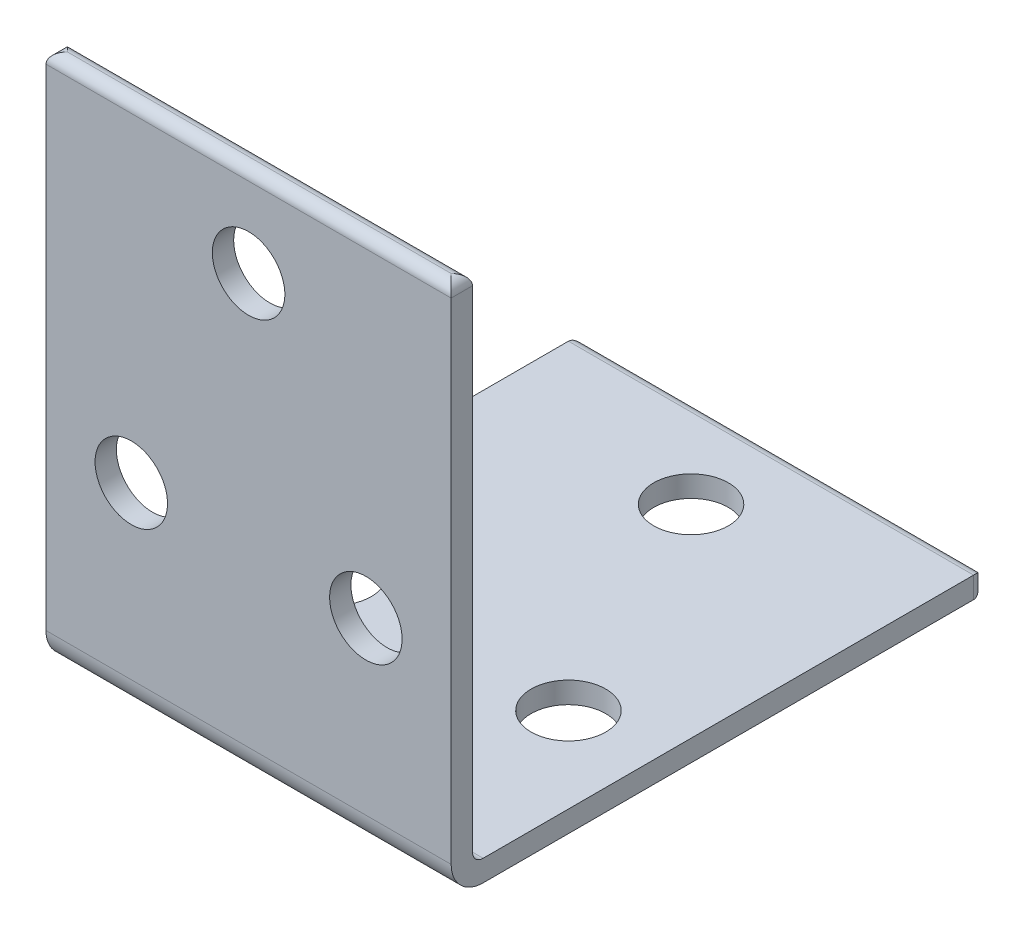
ISO-10303-21;
HEADER;
FILE_DESCRIPTION(('STEP AP214'),'2;1');
FILE_NAME('part.step','',(''),(''),'','','');
FILE_SCHEMA(('AUTOMOTIVE_DESIGN { 1 0 10303 214 1 1 1 1 }'));
ENDSEC;
DATA;
#1=APPLICATION_CONTEXT('core data for automotive mechanical design processes');
#2=APPLICATION_PROTOCOL_DEFINITION('international standard','automotive_design',2000,#1);
#3=PRODUCT_CONTEXT('',#1,'mechanical');
#4=PRODUCT('Part','Part','',(#3));
#5=PRODUCT_RELATED_PRODUCT_CATEGORY('part','',(#4));
#6=PRODUCT_DEFINITION_FORMATION('','',#4);
#7=PRODUCT_DEFINITION_CONTEXT('part definition',#1,'design');
#8=PRODUCT_DEFINITION('design','',#6,#7);
#9=PRODUCT_DEFINITION_SHAPE('','',#8);
#10=(LENGTH_UNIT() NAMED_UNIT(*) SI_UNIT(.MILLI.,.METRE.));
#11=(NAMED_UNIT(*) PLANE_ANGLE_UNIT() SI_UNIT($,.RADIAN.));
#12=(NAMED_UNIT(*) SI_UNIT($,.STERADIAN.) SOLID_ANGLE_UNIT());
#13=UNCERTAINTY_MEASURE_WITH_UNIT(LENGTH_MEASURE(1.E-05),#10,'distance_accuracy_value','');
#14=(GEOMETRIC_REPRESENTATION_CONTEXT(3) GLOBAL_UNCERTAINTY_ASSIGNED_CONTEXT((#13)) GLOBAL_UNIT_ASSIGNED_CONTEXT((#10,
#11,#12)) REPRESENTATION_CONTEXT('',''));
#15=CARTESIAN_POINT('',(0.,0.,0.));
#16=DIRECTION('',(0.,0.,1.));
#17=DIRECTION('',(1.,0.,0.));
#18=AXIS2_PLACEMENT_3D('',#15,#16,#17);
#19=CARTESIAN_POINT('',(38.,50.,48.));
#20=DIRECTION('',(0.,0.,1.));
#21=DIRECTION('',(1.,0.,0.));
#22=AXIS2_PLACEMENT_3D('',#19,#20,#21);
#23=PLANE('',#22);
#24=CARTESIAN_POINT('',(19.,41.5,48.));
#25=DIRECTION('',(0.,0.,-1.));
#26=DIRECTION('',(-1.,0.,0.));
#27=AXIS2_PLACEMENT_3D('',#24,#25,#26);
#28=CIRCLE('',#27,3.4);
#29=CARTESIAN_POINT('',(15.6,41.5,48.));
#30=VERTEX_POINT('',#29);
#31=EDGE_CURVE('E143',#30,#30,#28,.T.);
#32=ORIENTED_EDGE('',*,*,#31,.F.);
#33=EDGE_LOOP('',(#32));
#34=FACE_BOUND('',#33,.T.);
#35=CARTESIAN_POINT('',(30.,19.,48.));
#36=DIRECTION('',(0.,0.,-1.));
#37=DIRECTION('',(-1.,0.,0.));
#38=AXIS2_PLACEMENT_3D('',#35,#36,#37);
#39=CIRCLE('',#38,3.4);
#40=CARTESIAN_POINT('',(26.6,19.,48.));
#41=VERTEX_POINT('',#40);
#42=EDGE_CURVE('E128',#41,#41,#39,.T.);
#43=ORIENTED_EDGE('',*,*,#42,.F.);
#44=EDGE_LOOP('',(#43));
#45=FACE_BOUND('',#44,.T.);
#46=CARTESIAN_POINT('',(8.,19.,48.));
#47=DIRECTION('',(0.,0.,-1.));
#48=DIRECTION('',(-1.,0.,0.));
#49=AXIS2_PLACEMENT_3D('',#46,#47,#48);
#50=CIRCLE('',#49,3.4);
#51=CARTESIAN_POINT('',(4.6,19.,48.));
#52=VERTEX_POINT('',#51);
#53=EDGE_CURVE('E117',#52,#52,#50,.T.);
#54=ORIENTED_EDGE('',*,*,#53,.F.);
#55=EDGE_LOOP('',(#54));
#56=FACE_BOUND('',#55,.T.);
#57=DIRECTION('',(0.,1.,0.));
#58=VECTOR('',#57,1.);
#59=CARTESIAN_POINT('',(0.,50.,48.));
#60=LINE('',#59,#58);
#61=CARTESIAN_POINT('',(0.,3.00000000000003,48.));
#62=VERTEX_POINT('',#61);
#63=CARTESIAN_POINT('',(0.,49.,48.));
#64=VERTEX_POINT('',#63);
#65=EDGE_CURVE('E173',#62,#64,#60,.T.);
#66=ORIENTED_EDGE('',*,*,#65,.T.);
#67=DIRECTION('',(-1.,0.,0.));
#68=VECTOR('',#67,1.);
#69=CARTESIAN_POINT('',(38.,49.,48.));
#70=LINE('',#69,#68);
#71=CARTESIAN_POINT('',(38.,49.,48.));
#72=VERTEX_POINT('',#71);
#73=EDGE_CURVE('E11',#64,#72,#70,.F.);
#74=ORIENTED_EDGE('',*,*,#73,.T.);
#75=DIRECTION('',(0.,1.,0.));
#76=VECTOR('',#75,1.);
#77=CARTESIAN_POINT('',(38.,50.,48.));
#78=LINE('',#77,#76);
#79=CARTESIAN_POINT('',(38.,3.00000000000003,48.));
#80=VERTEX_POINT('',#79);
#81=EDGE_CURVE('E147',#80,#72,#78,.T.);
#82=ORIENTED_EDGE('',*,*,#81,.F.);
#83=DIRECTION('',(-1.,0.,0.));
#84=VECTOR('',#83,1.);
#85=CARTESIAN_POINT('',(38.,3.00000000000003,48.));
#86=LINE('',#85,#84);
#87=EDGE_CURVE('E172',#80,#62,#86,.T.);
#88=ORIENTED_EDGE('',*,*,#87,.T.);
#89=EDGE_LOOP('',(#66,#74,#82,#88));
#90=FACE_BOUND('',#89,.T.);
#91=ADVANCED_FACE('F51',(#34,#45,#56,#90),#23,.F.);
#92=CARTESIAN_POINT('',(38.,50.,50.));
#93=DIRECTION('',(0.,0.,-1.));
#94=DIRECTION('',(-1.,0.,0.));
#95=AXIS2_PLACEMENT_3D('',#92,#93,#94);
#96=PLANE('',#95);
#97=CARTESIAN_POINT('',(19.,41.5,50.));
#98=DIRECTION('',(0.,0.,-1.));
#99=DIRECTION('',(-1.,0.,0.));
#100=AXIS2_PLACEMENT_3D('',#97,#98,#99);
#101=CIRCLE('',#100,3.4);
#102=CARTESIAN_POINT('',(15.6,41.5,50.));
#103=VERTEX_POINT('',#102);
#104=EDGE_CURVE('E55',#103,#103,#101,.T.);
#105=ORIENTED_EDGE('',*,*,#104,.T.);
#106=EDGE_LOOP('',(#105));
#107=FACE_BOUND('',#106,.T.);
#108=CARTESIAN_POINT('',(30.,19.,50.));
#109=DIRECTION('',(0.,0.,-1.));
#110=DIRECTION('',(-1.,0.,0.));
#111=AXIS2_PLACEMENT_3D('',#108,#109,#110);
#112=CIRCLE('',#111,3.4);
#113=CARTESIAN_POINT('',(26.6,19.,50.));
#114=VERTEX_POINT('',#113);
#115=EDGE_CURVE('E125',#114,#114,#112,.T.);
#116=ORIENTED_EDGE('',*,*,#115,.T.);
#117=EDGE_LOOP('',(#116));
#118=FACE_BOUND('',#117,.T.);
#119=CARTESIAN_POINT('',(8.,19.,50.));
#120=DIRECTION('',(0.,0.,-1.));
#121=DIRECTION('',(-1.,0.,0.));
#122=AXIS2_PLACEMENT_3D('',#119,#120,#121);
#123=CIRCLE('',#122,3.4);
#124=CARTESIAN_POINT('',(4.6,19.,50.));
#125=VERTEX_POINT('',#124);
#126=EDGE_CURVE('E110',#125,#125,#123,.T.);
#127=ORIENTED_EDGE('',*,*,#126,.T.);
#128=EDGE_LOOP('',(#127));
#129=FACE_BOUND('',#128,.T.);
#130=DIRECTION('',(0.,-1.,0.));
#131=VECTOR('',#130,1.);
#132=CARTESIAN_POINT('',(38.,50.,50.));
#133=LINE('',#132,#131);
#134=CARTESIAN_POINT('',(38.,49.,50.));
#135=VERTEX_POINT('',#134);
#136=CARTESIAN_POINT('',(38.,3.00000000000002,50.));
#137=VERTEX_POINT('',#136);
#138=EDGE_CURVE('E151',#135,#137,#133,.T.);
#139=ORIENTED_EDGE('',*,*,#138,.F.);
#140=DIRECTION('',(-1.,0.,0.));
#141=VECTOR('',#140,1.);
#142=CARTESIAN_POINT('',(38.,49.,50.));
#143=LINE('',#142,#141);
#144=CARTESIAN_POINT('',(0.,49.,50.));
#145=VERTEX_POINT('',#144);
#146=EDGE_CURVE('E62',#135,#145,#143,.T.);
#147=ORIENTED_EDGE('',*,*,#146,.T.);
#148=DIRECTION('',(0.,-1.,0.));
#149=VECTOR('',#148,1.);
#150=CARTESIAN_POINT('',(0.,50.,50.));
#151=LINE('',#150,#149);
#152=CARTESIAN_POINT('',(0.,3.00000000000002,50.));
#153=VERTEX_POINT('',#152);
#154=EDGE_CURVE('E177',#145,#153,#151,.T.);
#155=ORIENTED_EDGE('',*,*,#154,.T.);
#156=DIRECTION('',(-1.,0.,0.));
#157=VECTOR('',#156,1.);
#158=CARTESIAN_POINT('',(38.,3.00000000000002,50.));
#159=LINE('',#158,#157);
#160=EDGE_CURVE('E207',#137,#153,#159,.T.);
#161=ORIENTED_EDGE('',*,*,#160,.F.);
#162=EDGE_LOOP('',(#139,#147,#155,#161));
#163=FACE_BOUND('',#162,.T.);
#164=ADVANCED_FACE('F308',(#107,#118,#129,#163),#96,.F.);
#165=CARTESIAN_POINT('',(38.,3.,47.));
#166=DIRECTION('',(-1.,0.,0.));
#167=DIRECTION('',(0.,0.,1.));
#168=AXIS2_PLACEMENT_3D('',#165,#166,#167);
#169=CYLINDRICAL_SURFACE('',#168,3.);
#170=CARTESIAN_POINT('',(0.,3.,47.));
#171=DIRECTION('',(1.,0.,0.));
#172=DIRECTION('',(0.,0.,-1.));
#173=AXIS2_PLACEMENT_3D('',#170,#171,#172);
#174=CIRCLE('',#173,3.);
#175=CARTESIAN_POINT('',(0.,0.,47.));
#176=VERTEX_POINT('',#175);
#177=EDGE_CURVE('E181',#153,#176,#174,.T.);
#178=ORIENTED_EDGE('',*,*,#177,.T.);
#179=DIRECTION('',(-1.,0.,0.));
#180=VECTOR('',#179,1.);
#181=CARTESIAN_POINT('',(38.,0.,47.));
#182=LINE('',#181,#180);
#183=CARTESIAN_POINT('',(38.,0.,47.));
#184=VERTEX_POINT('',#183);
#185=EDGE_CURVE('E203',#184,#176,#182,.T.);
#186=ORIENTED_EDGE('',*,*,#185,.F.);
#187=CARTESIAN_POINT('',(38.,3.,47.));
#188=DIRECTION('',(1.,0.,0.));
#189=DIRECTION('',(0.,0.,-1.));
#190=AXIS2_PLACEMENT_3D('',#187,#188,#189);
#191=CIRCLE('',#190,3.);
#192=EDGE_CURVE('E156',#137,#184,#191,.T.);
#193=ORIENTED_EDGE('',*,*,#192,.F.);
#194=ORIENTED_EDGE('',*,*,#160,.T.);
#195=EDGE_LOOP('',(#178,#186,#193,#194));
#196=FACE_BOUND('',#195,.T.);
#197=ADVANCED_FACE('F314',(#196),#169,.T.);
#198=CARTESIAN_POINT('',(38.,0.,47.));
#199=DIRECTION('',(0.,1.,0.));
#200=DIRECTION('',(0.,0.,1.));
#201=AXIS2_PLACEMENT_3D('',#198,#199,#200);
#202=PLANE('',#201);
#203=CARTESIAN_POINT('',(19.,0.,8.5));
#204=DIRECTION('',(0.,1.,0.));
#205=DIRECTION('',(0.,0.,1.));
#206=AXIS2_PLACEMENT_3D('',#203,#204,#205);
#207=CIRCLE('',#206,3.5);
#208=CARTESIAN_POINT('',(19.,0.,12.));
#209=VERTEX_POINT('',#208);
#210=EDGE_CURVE('E568',#209,#209,#207,.T.);
#211=ORIENTED_EDGE('',*,*,#210,.T.);
#212=EDGE_LOOP('',(#211));
#213=FACE_BOUND('',#212,.T.);
#214=CARTESIAN_POINT('',(8.,0.,31.));
#215=DIRECTION('',(0.,1.,0.));
#216=DIRECTION('',(0.,0.,1.));
#217=AXIS2_PLACEMENT_3D('',#214,#215,#216);
#218=CIRCLE('',#217,3.5);
#219=CARTESIAN_POINT('',(8.,0.,34.5));
#220=VERTEX_POINT('',#219);
#221=EDGE_CURVE('E576',#220,#220,#218,.T.);
#222=ORIENTED_EDGE('',*,*,#221,.T.);
#223=EDGE_LOOP('',(#222));
#224=FACE_BOUND('',#223,.T.);
#225=CARTESIAN_POINT('',(30.,0.,31.));
#226=DIRECTION('',(0.,1.,0.));
#227=DIRECTION('',(0.,0.,1.));
#228=AXIS2_PLACEMENT_3D('',#225,#226,#227);
#229=CIRCLE('',#228,3.5);
#230=CARTESIAN_POINT('',(30.,0.,34.5));
#231=VERTEX_POINT('',#230);
#232=EDGE_CURVE('E586',#231,#231,#229,.T.);
#233=ORIENTED_EDGE('',*,*,#232,.T.);
#234=EDGE_LOOP('',(#233));
#235=FACE_BOUND('',#234,.T.);
#236=DIRECTION('',(0.,0.,-1.));
#237=VECTOR('',#236,1.);
#238=CARTESIAN_POINT('',(0.,0.,47.));
#239=LINE('',#238,#237);
#240=CARTESIAN_POINT('',(0.,0.,1.));
#241=VERTEX_POINT('',#240);
#242=EDGE_CURVE('E185',#176,#241,#239,.T.);
#243=ORIENTED_EDGE('',*,*,#242,.T.);
#244=DIRECTION('',(-1.,0.,0.));
#245=VECTOR('',#244,1.);
#246=CARTESIAN_POINT('',(38.,0.,1.));
#247=LINE('',#246,#245);
#248=CARTESIAN_POINT('',(38.,0.,1.));
#249=VERTEX_POINT('',#248);
#250=EDGE_CURVE('E211',#241,#249,#247,.F.);
#251=ORIENTED_EDGE('',*,*,#250,.T.);
#252=DIRECTION('',(0.,0.,-1.));
#253=VECTOR('',#252,1.);
#254=CARTESIAN_POINT('',(38.,0.,47.));
#255=LINE('',#254,#253);
#256=EDGE_CURVE('E160',#184,#249,#255,.T.);
#257=ORIENTED_EDGE('',*,*,#256,.F.);
#258=ORIENTED_EDGE('',*,*,#185,.T.);
#259=EDGE_LOOP('',(#243,#251,#257,#258));
#260=FACE_BOUND('',#259,.T.);
#261=ADVANCED_FACE('F320',(#213,#224,#235,#260),#202,.F.);
#262=CARTESIAN_POINT('',(38.,2.,47.));
#263=DIRECTION('',(0.,-1.,0.));
#264=DIRECTION('',(0.,0.,-1.));
#265=AXIS2_PLACEMENT_3D('',#262,#263,#264);
#266=PLANE('',#265);
#267=CARTESIAN_POINT('',(19.,2.,8.5));
#268=DIRECTION('',(0.,1.,0.));
#269=DIRECTION('',(0.,0.,1.));
#270=AXIS2_PLACEMENT_3D('',#267,#268,#269);
#271=CIRCLE('',#270,3.5);
#272=CARTESIAN_POINT('',(19.,2.,12.));
#273=VERTEX_POINT('',#272);
#274=EDGE_CURVE('E566',#273,#273,#271,.T.);
#275=ORIENTED_EDGE('',*,*,#274,.F.);
#276=EDGE_LOOP('',(#275));
#277=FACE_BOUND('',#276,.T.);
#278=CARTESIAN_POINT('',(8.,2.,31.));
#279=DIRECTION('',(0.,1.,0.));
#280=DIRECTION('',(0.,0.,1.));
#281=AXIS2_PLACEMENT_3D('',#278,#279,#280);
#282=CIRCLE('',#281,3.5);
#283=CARTESIAN_POINT('',(8.,2.,34.5));
#284=VERTEX_POINT('',#283);
#285=EDGE_CURVE('E570',#284,#284,#282,.T.);
#286=ORIENTED_EDGE('',*,*,#285,.F.);
#287=EDGE_LOOP('',(#286));
#288=FACE_BOUND('',#287,.T.);
#289=CARTESIAN_POINT('',(30.,2.,31.));
#290=DIRECTION('',(0.,1.,0.));
#291=DIRECTION('',(0.,0.,1.));
#292=AXIS2_PLACEMENT_3D('',#289,#290,#291);
#293=CIRCLE('',#292,3.5);
#294=CARTESIAN_POINT('',(30.,2.,34.5));
#295=VERTEX_POINT('',#294);
#296=EDGE_CURVE('E583',#295,#295,#293,.T.);
#297=ORIENTED_EDGE('',*,*,#296,.F.);
#298=EDGE_LOOP('',(#297));
#299=FACE_BOUND('',#298,.T.);
#300=DIRECTION('',(0.,0.,1.));
#301=VECTOR('',#300,1.);
#302=CARTESIAN_POINT('',(38.,2.,47.));
#303=LINE('',#302,#301);
#304=CARTESIAN_POINT('',(38.,2.,1.));
#305=VERTEX_POINT('',#304);
#306=CARTESIAN_POINT('',(38.,2.,47.));
#307=VERTEX_POINT('',#306);
#308=EDGE_CURVE('E164',#305,#307,#303,.T.);
#309=ORIENTED_EDGE('',*,*,#308,.F.);
#310=DIRECTION('',(-1.,0.,0.));
#311=VECTOR('',#310,1.);
#312=CARTESIAN_POINT('',(38.,2.,1.));
#313=LINE('',#312,#311);
#314=CARTESIAN_POINT('',(0.,2.,1.));
#315=VERTEX_POINT('',#314);
#316=EDGE_CURVE('E223',#305,#315,#313,.T.);
#317=ORIENTED_EDGE('',*,*,#316,.T.);
#318=DIRECTION('',(0.,0.,1.));
#319=VECTOR('',#318,1.);
#320=CARTESIAN_POINT('',(0.,2.,47.));
#321=LINE('',#320,#319);
#322=CARTESIAN_POINT('',(0.,2.,47.));
#323=VERTEX_POINT('',#322);
#324=EDGE_CURVE('E189',#315,#323,#321,.T.);
#325=ORIENTED_EDGE('',*,*,#324,.T.);
#326=DIRECTION('',(-1.,0.,0.));
#327=VECTOR('',#326,1.);
#328=CARTESIAN_POINT('',(38.,2.,47.));
#329=LINE('',#328,#327);
#330=EDGE_CURVE('E199',#307,#323,#329,.T.);
#331=ORIENTED_EDGE('',*,*,#330,.F.);
#332=EDGE_LOOP('',(#309,#317,#325,#331));
#333=FACE_BOUND('',#332,.T.);
#334=ADVANCED_FACE('F288',(#277,#288,#299,#333),#266,.F.);
#335=CARTESIAN_POINT('',(38.,3.,47.));
#336=DIRECTION('',(-1.,0.,0.));
#337=DIRECTION('',(0.,0.,1.));
#338=AXIS2_PLACEMENT_3D('',#335,#336,#337);
#339=CYLINDRICAL_SURFACE('',#338,1.);
#340=CARTESIAN_POINT('',(0.,3.,47.));
#341=DIRECTION('',(-1.,0.,0.));
#342=DIRECTION('',(0.,0.,-1.));
#343=AXIS2_PLACEMENT_3D('',#340,#341,#342);
#344=CIRCLE('',#343,1.);
#345=EDGE_CURVE('E152',#323,#62,#344,.T.);
#346=ORIENTED_EDGE('',*,*,#345,.T.);
#347=ORIENTED_EDGE('',*,*,#87,.F.);
#348=CARTESIAN_POINT('',(38.,3.,47.));
#349=DIRECTION('',(-1.,0.,0.));
#350=DIRECTION('',(0.,0.,-1.));
#351=AXIS2_PLACEMENT_3D('',#348,#349,#350);
#352=CIRCLE('',#351,1.);
#353=EDGE_CURVE('E168',#307,#80,#352,.T.);
#354=ORIENTED_EDGE('',*,*,#353,.F.);
#355=ORIENTED_EDGE('',*,*,#330,.T.);
#356=EDGE_LOOP('',(#346,#347,#354,#355));
#357=FACE_BOUND('',#356,.T.);
#358=ADVANCED_FACE('F297',(#357),#339,.F.);
#359=CARTESIAN_POINT('',(38.,3.,47.));
#360=DIRECTION('',(1.,0.,0.));
#361=DIRECTION('',(0.,0.,-1.));
#362=AXIS2_PLACEMENT_3D('',#359,#360,#361);
#363=PLANE('',#362);
#364=ORIENTED_EDGE('',*,*,#256,.T.);
#365=DIRECTION('',(0.,1.,0.));
#366=VECTOR('',#365,1.);
#367=CARTESIAN_POINT('',(38.,2.,1.));
#368=LINE('',#367,#366);
#369=EDGE_CURVE('E219',#249,#305,#368,.T.);
#370=ORIENTED_EDGE('',*,*,#369,.T.);
#371=ORIENTED_EDGE('',*,*,#308,.T.);
#372=ORIENTED_EDGE('',*,*,#353,.T.);
#373=ORIENTED_EDGE('',*,*,#81,.T.);
#374=DIRECTION('',(0.,0.,1.));
#375=VECTOR('',#374,1.);
#376=CARTESIAN_POINT('',(38.,49.,50.));
#377=LINE('',#376,#375);
#378=EDGE_CURVE('E215',#72,#135,#377,.T.);
#379=ORIENTED_EDGE('',*,*,#378,.T.);
#380=ORIENTED_EDGE('',*,*,#138,.T.);
#381=ORIENTED_EDGE('',*,*,#192,.T.);
#382=EDGE_LOOP('',(#364,#370,#371,#372,#373,#379,#380,#381));
#383=FACE_BOUND('',#382,.T.);
#384=ADVANCED_FACE('F303',(#383),#363,.T.);
#385=CARTESIAN_POINT('',(0.,3.,47.));
#386=DIRECTION('',(1.,0.,0.));
#387=DIRECTION('',(0.,0.,-1.));
#388=AXIS2_PLACEMENT_3D('',#385,#386,#387);
#389=PLANE('',#388);
#390=ORIENTED_EDGE('',*,*,#324,.F.);
#391=DIRECTION('',(0.,1.,0.));
#392=VECTOR('',#391,1.);
#393=CARTESIAN_POINT('',(0.,3.,1.));
#394=LINE('',#393,#392);
#395=EDGE_CURVE('E229',#315,#241,#394,.F.);
#396=ORIENTED_EDGE('',*,*,#395,.T.);
#397=ORIENTED_EDGE('',*,*,#242,.F.);
#398=ORIENTED_EDGE('',*,*,#177,.F.);
#399=ORIENTED_EDGE('',*,*,#154,.F.);
#400=DIRECTION('',(0.,0.,1.));
#401=VECTOR('',#400,1.);
#402=CARTESIAN_POINT('',(0.,49.,47.));
#403=LINE('',#402,#401);
#404=EDGE_CURVE('E107',#145,#64,#403,.F.);
#405=ORIENTED_EDGE('',*,*,#404,.T.);
#406=ORIENTED_EDGE('',*,*,#65,.F.);
#407=ORIENTED_EDGE('',*,*,#345,.F.);
#408=EDGE_LOOP('',(#390,#396,#397,#398,#399,#405,#406,#407));
#409=FACE_BOUND('',#408,.T.);
#410=ADVANCED_FACE('F292',(#409),#389,.F.);
#411=CARTESIAN_POINT('',(37.,3.,1.));
#412=DIRECTION('',(0.,-1.,0.));
#413=DIRECTION('',(0.,0.,-1.));
#414=AXIS2_PLACEMENT_3D('',#411,#412,#413);
#415=CYLINDRICAL_SURFACE('',#414,1.);
#416=CARTESIAN_POINT('',(37.,1.,1.));
#417=DIRECTION('',(-0.707106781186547,0.707106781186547,0.));
#418=DIRECTION('',(-0.707106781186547,-0.707106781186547,0.));
#419=AXIS2_PLACEMENT_3D('',#416,#417,#418);
#420=ELLIPSE('',#419,1.41421356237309,1.);
#421=CARTESIAN_POINT('',(37.,1.,0.));
#422=VERTEX_POINT('',#421);
#423=EDGE_CURVE('E120',#305,#422,#420,.T.);
#424=ORIENTED_EDGE('',*,*,#423,.F.);
#425=ORIENTED_EDGE('',*,*,#369,.F.);
#426=CARTESIAN_POINT('',(37.,1.,1.));
#427=DIRECTION('',(-0.707106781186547,-0.707106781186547,0.));
#428=DIRECTION('',(0.707106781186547,-0.707106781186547,0.));
#429=AXIS2_PLACEMENT_3D('',#426,#427,#428);
#430=ELLIPSE('',#429,1.41421356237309,1.);
#431=EDGE_CURVE('E242',#422,#249,#430,.T.);
#432=ORIENTED_EDGE('',*,*,#431,.F.);
#433=EDGE_LOOP('',(#424,#425,#432));
#434=FACE_BOUND('',#433,.T.);
#435=ADVANCED_FACE('F263',(#434),#415,.T.);
#436=CARTESIAN_POINT('',(38.,1.,1.));
#437=DIRECTION('',(-1.,0.,0.));
#438=DIRECTION('',(0.,0.,1.));
#439=AXIS2_PLACEMENT_3D('',#436,#437,#438);
#440=CYLINDRICAL_SURFACE('',#439,1.);
#441=CARTESIAN_POINT('',(1.,1.,1.));
#442=DIRECTION('',(0.707106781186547,0.707106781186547,0.));
#443=DIRECTION('',(-0.707106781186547,0.707106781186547,0.));
#444=AXIS2_PLACEMENT_3D('',#441,#442,#443);
#445=ELLIPSE('',#444,1.41421356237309,1.);
#446=CARTESIAN_POINT('',(1.,1.,0.));
#447=VERTEX_POINT('',#446);
#448=EDGE_CURVE('E245',#315,#447,#445,.F.);
#449=ORIENTED_EDGE('',*,*,#448,.F.);
#450=ORIENTED_EDGE('',*,*,#316,.F.);
#451=ORIENTED_EDGE('',*,*,#423,.T.);
#452=DIRECTION('',(-1.,0.,0.));
#453=VECTOR('',#452,1.);
#454=CARTESIAN_POINT('',(38.,1.,0.));
#455=LINE('',#454,#453);
#456=EDGE_CURVE('E238',#447,#422,#455,.F.);
#457=ORIENTED_EDGE('',*,*,#456,.F.);
#458=EDGE_LOOP('',(#449,#450,#451,#457));
#459=FACE_BOUND('',#458,.T.);
#460=ADVANCED_FACE('F259',(#459),#440,.T.);
#461=CARTESIAN_POINT('',(1.,2.,1.));
#462=DIRECTION('',(0.,1.,0.));
#463=DIRECTION('',(0.,0.,1.));
#464=AXIS2_PLACEMENT_3D('',#461,#462,#463);
#465=CYLINDRICAL_SURFACE('',#464,1.);
#466=ORIENTED_EDGE('',*,*,#395,.F.);
#467=ORIENTED_EDGE('',*,*,#448,.T.);
#468=CARTESIAN_POINT('',(1.,1.,1.));
#469=DIRECTION('',(-0.707106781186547,0.707106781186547,0.));
#470=DIRECTION('',(0.707106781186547,0.707106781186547,0.));
#471=AXIS2_PLACEMENT_3D('',#468,#469,#470);
#472=ELLIPSE('',#471,1.41421356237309,1.);
#473=EDGE_CURVE('E124',#241,#447,#472,.F.);
#474=ORIENTED_EDGE('',*,*,#473,.F.);
#475=EDGE_LOOP('',(#466,#467,#474));
#476=FACE_BOUND('',#475,.T.);
#477=ADVANCED_FACE('F269',(#476),#465,.T.);
#478=CARTESIAN_POINT('',(38.,1.,1.));
#479=DIRECTION('',(-1.,0.,0.));
#480=DIRECTION('',(0.,0.,1.));
#481=AXIS2_PLACEMENT_3D('',#478,#479,#480);
#482=CYLINDRICAL_SURFACE('',#481,1.);
#483=ORIENTED_EDGE('',*,*,#431,.T.);
#484=ORIENTED_EDGE('',*,*,#250,.F.);
#485=ORIENTED_EDGE('',*,*,#473,.T.);
#486=ORIENTED_EDGE('',*,*,#456,.T.);
#487=EDGE_LOOP('',(#483,#484,#485,#486));
#488=FACE_BOUND('',#487,.T.);
#489=ADVANCED_FACE('F267',(#488),#482,.T.);
#490=CARTESIAN_POINT('',(38.,49.,49.));
#491=DIRECTION('',(-1.,0.,0.));
#492=DIRECTION('',(0.,0.,1.));
#493=AXIS2_PLACEMENT_3D('',#490,#491,#492);
#494=CYLINDRICAL_SURFACE('',#493,1.);
#495=CARTESIAN_POINT('',(37.,49.,49.));
#496=DIRECTION('',(-0.707106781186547,0.,-0.707106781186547));
#497=DIRECTION('',(0.707106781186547,0.,-0.707106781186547));
#498=AXIS2_PLACEMENT_3D('',#495,#496,#497);
#499=ELLIPSE('',#498,1.41421356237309,1.);
#500=CARTESIAN_POINT('',(37.,50.,49.));
#501=VERTEX_POINT('',#500);
#502=EDGE_CURVE('E90',#72,#501,#499,.F.);
#503=ORIENTED_EDGE('',*,*,#502,.F.);
#504=ORIENTED_EDGE('',*,*,#73,.F.);
#505=CARTESIAN_POINT('',(1.,49.,49.));
#506=DIRECTION('',(-0.707106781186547,0.,0.707106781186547));
#507=DIRECTION('',(0.707106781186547,0.,0.707106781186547));
#508=AXIS2_PLACEMENT_3D('',#505,#506,#507);
#509=ELLIPSE('',#508,1.41421356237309,1.);
#510=CARTESIAN_POINT('',(1.,50.,49.));
#511=VERTEX_POINT('',#510);
#512=EDGE_CURVE('E96',#511,#64,#509,.T.);
#513=ORIENTED_EDGE('',*,*,#512,.F.);
#514=DIRECTION('',(-1.,0.,0.));
#515=VECTOR('',#514,1.);
#516=CARTESIAN_POINT('',(38.,50.,49.));
#517=LINE('',#516,#515);
#518=EDGE_CURVE('E97',#501,#511,#517,.T.);
#519=ORIENTED_EDGE('',*,*,#518,.F.);
#520=EDGE_LOOP('',(#503,#504,#513,#519));
#521=FACE_BOUND('',#520,.T.);
#522=ADVANCED_FACE('F53',(#521),#494,.T.);
#523=CARTESIAN_POINT('',(37.,49.,47.));
#524=DIRECTION('',(0.,0.,-1.));
#525=DIRECTION('',(-1.,0.,0.));
#526=AXIS2_PLACEMENT_3D('',#523,#524,#525);
#527=CYLINDRICAL_SURFACE('',#526,1.);
#528=ORIENTED_EDGE('',*,*,#378,.F.);
#529=ORIENTED_EDGE('',*,*,#502,.T.);
#530=CARTESIAN_POINT('',(37.,49.,49.));
#531=DIRECTION('',(0.707106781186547,0.,-0.707106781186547));
#532=DIRECTION('',(-0.707106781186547,0.,-0.707106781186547));
#533=AXIS2_PLACEMENT_3D('',#530,#531,#532);
#534=ELLIPSE('',#533,1.41421356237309,1.);
#535=EDGE_CURVE('E103',#135,#501,#534,.F.);
#536=ORIENTED_EDGE('',*,*,#535,.F.);
#537=EDGE_LOOP('',(#528,#529,#536));
#538=FACE_BOUND('',#537,.T.);
#539=ADVANCED_FACE('F305',(#538),#527,.T.);
#540=CARTESIAN_POINT('',(1.,49.,50.));
#541=DIRECTION('',(0.,0.,1.));
#542=DIRECTION('',(1.,0.,0.));
#543=AXIS2_PLACEMENT_3D('',#540,#541,#542);
#544=CYLINDRICAL_SURFACE('',#543,1.);
#545=ORIENTED_EDGE('',*,*,#512,.T.);
#546=ORIENTED_EDGE('',*,*,#404,.F.);
#547=CARTESIAN_POINT('',(1.,49.,49.));
#548=DIRECTION('',(0.707106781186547,0.,0.707106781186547));
#549=DIRECTION('',(-0.707106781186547,0.,0.707106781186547));
#550=AXIS2_PLACEMENT_3D('',#547,#548,#549);
#551=ELLIPSE('',#550,1.41421356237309,1.);
#552=EDGE_CURVE('E71',#511,#145,#551,.T.);
#553=ORIENTED_EDGE('',*,*,#552,.F.);
#554=EDGE_LOOP('',(#545,#546,#553));
#555=FACE_BOUND('',#554,.T.);
#556=ADVANCED_FACE('F106',(#555),#544,.T.);
#557=CARTESIAN_POINT('',(38.,49.,49.));
#558=DIRECTION('',(-1.,0.,0.));
#559=DIRECTION('',(0.,0.,1.));
#560=AXIS2_PLACEMENT_3D('',#557,#558,#559);
#561=CYLINDRICAL_SURFACE('',#560,1.);
#562=ORIENTED_EDGE('',*,*,#535,.T.);
#563=ORIENTED_EDGE('',*,*,#518,.T.);
#564=ORIENTED_EDGE('',*,*,#552,.T.);
#565=ORIENTED_EDGE('',*,*,#146,.F.);
#566=EDGE_LOOP('',(#562,#563,#564,#565));
#567=FACE_BOUND('',#566,.T.);
#568=ADVANCED_FACE('F102',(#567),#561,.T.);
#569=CARTESIAN_POINT('',(8.,19.,48.));
#570=DIRECTION('',(0.,0.,-1.));
#571=DIRECTION('',(-1.,0.,0.));
#572=AXIS2_PLACEMENT_3D('',#569,#570,#571);
#573=CYLINDRICAL_SURFACE('',#572,3.4);
#574=ORIENTED_EDGE('',*,*,#53,.T.);
#575=EDGE_LOOP('',(#574));
#576=FACE_BOUND('',#575,.T.);
#577=ORIENTED_EDGE('',*,*,#126,.F.);
#578=EDGE_LOOP('',(#577));
#579=FACE_BOUND('',#578,.T.);
#580=ADVANCED_FACE('F360',(#576,#579),#573,.F.);
#581=CARTESIAN_POINT('',(30.,19.,48.));
#582=DIRECTION('',(0.,0.,-1.));
#583=DIRECTION('',(-1.,0.,0.));
#584=AXIS2_PLACEMENT_3D('',#581,#582,#583);
#585=CYLINDRICAL_SURFACE('',#584,3.4);
#586=ORIENTED_EDGE('',*,*,#42,.T.);
#587=EDGE_LOOP('',(#586));
#588=FACE_BOUND('',#587,.T.);
#589=ORIENTED_EDGE('',*,*,#115,.F.);
#590=EDGE_LOOP('',(#589));
#591=FACE_BOUND('',#590,.T.);
#592=ADVANCED_FACE('F456',(#588,#591),#585,.F.);
#593=CARTESIAN_POINT('',(19.,41.5,48.));
#594=DIRECTION('',(0.,0.,-1.));
#595=DIRECTION('',(-1.,0.,0.));
#596=AXIS2_PLACEMENT_3D('',#593,#594,#595);
#597=CYLINDRICAL_SURFACE('',#596,3.4);
#598=ORIENTED_EDGE('',*,*,#31,.T.);
#599=EDGE_LOOP('',(#598));
#600=FACE_BOUND('',#599,.T.);
#601=ORIENTED_EDGE('',*,*,#104,.F.);
#602=EDGE_LOOP('',(#601));
#603=FACE_BOUND('',#602,.T.);
#604=ADVANCED_FACE('F468',(#600,#603),#597,.F.);
#605=CARTESIAN_POINT('',(30.,2.,31.));
#606=DIRECTION('',(0.,1.,0.));
#607=DIRECTION('',(0.,0.,1.));
#608=AXIS2_PLACEMENT_3D('',#605,#606,#607);
#609=CYLINDRICAL_SURFACE('',#608,3.5);
#610=ORIENTED_EDGE('',*,*,#296,.T.);
#611=EDGE_LOOP('',(#610));
#612=FACE_BOUND('',#611,.T.);
#613=ORIENTED_EDGE('',*,*,#232,.F.);
#614=EDGE_LOOP('',(#613));
#615=FACE_BOUND('',#614,.T.);
#616=ADVANCED_FACE('F478',(#612,#615),#609,.F.);
#617=CARTESIAN_POINT('',(8.,2.,31.));
#618=DIRECTION('',(0.,1.,0.));
#619=DIRECTION('',(0.,0.,1.));
#620=AXIS2_PLACEMENT_3D('',#617,#618,#619);
#621=CYLINDRICAL_SURFACE('',#620,3.5);
#622=ORIENTED_EDGE('',*,*,#285,.T.);
#623=EDGE_LOOP('',(#622));
#624=FACE_BOUND('',#623,.T.);
#625=ORIENTED_EDGE('',*,*,#221,.F.);
#626=EDGE_LOOP('',(#625));
#627=FACE_BOUND('',#626,.T.);
#628=ADVANCED_FACE('F504',(#624,#627),#621,.F.);
#629=CARTESIAN_POINT('',(19.,2.,8.5));
#630=DIRECTION('',(0.,1.,0.));
#631=DIRECTION('',(0.,0.,1.));
#632=AXIS2_PLACEMENT_3D('',#629,#630,#631);
#633=CYLINDRICAL_SURFACE('',#632,3.5);
#634=ORIENTED_EDGE('',*,*,#274,.T.);
#635=EDGE_LOOP('',(#634));
#636=FACE_BOUND('',#635,.T.);
#637=ORIENTED_EDGE('',*,*,#210,.F.);
#638=EDGE_LOOP('',(#637));
#639=FACE_BOUND('',#638,.T.);
#640=ADVANCED_FACE('F516',(#636,#639),#633,.F.);
#641=CLOSED_SHELL('',(#91,#164,#197,#261,#334,#358,#384,#410,#435,#460,#477,#489,#522,#539,#556,
#568,#580,#592,#604,#616,#628,#640));
#642=MANIFOLD_SOLID_BREP('B2',#641);
#643=ADVANCED_BREP_SHAPE_REPRESENTATION('',(#18,#642),#14);
#644=SHAPE_DEFINITION_REPRESENTATION(#9,#643);
ENDSEC;
END-ISO-10303-21;
